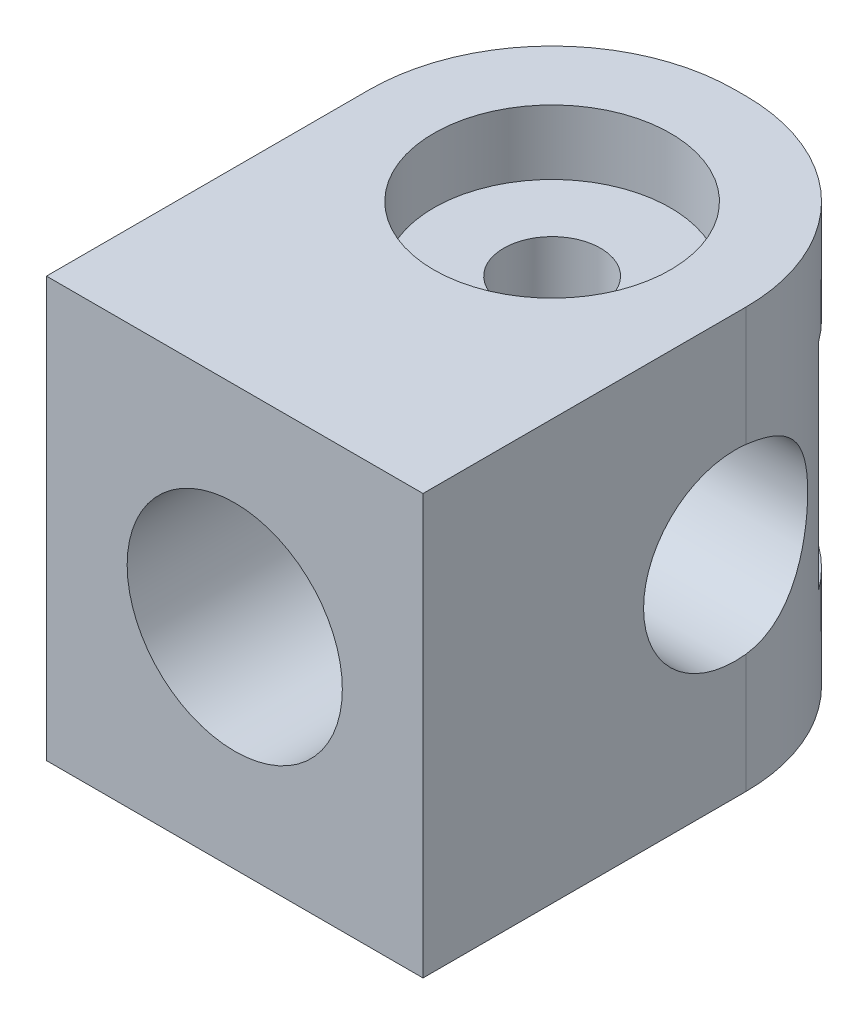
from build123d import *
from build123d.topology import SkipClean

# Parameters (mm, degrees)
ESQUISSE1_W             = 35
ESQUISSE1_H             = 39
BOSS_EXTRU_1_DEPTH      = 47
ENL_V_MAT_EXTRU_1_DEPTH = 20
CONG_1_R                = 17
ESQUISSE3_W             = 1
ESQUISSE3_H             = 20
ESQUISSE3_W_2           = 17
ENL_V_MAT_EXTRU_2_DEPTH = 7
ENL_V_MAT_EXTRU_3_DEPTH = 29
ESQUISSE5_R             = 4.5
ENL_V_MAT_EXTRU_4_DEPTH = 71.391760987
ESQUISSE7_R             = 11
ENL_V_MAT_EXTRU_5_DEPTH = 6
ENL_V_START             = -6
ESQUISSE8_R             = 11
ENL_V_MAT_EXTRU_6_DEPTH = 6
ENL_V_MAT_EXTRU_7_DEPTH = 6


with BuildPart() as part:
    # Esquisse1 → Boss.-Extru.1 (new body)
    with BuildSketch(Plane.XY):
        with Locations((17.5, -19.5)):
            Rectangle(ESQUISSE1_W, ESQUISSE1_H)
    extrude(amount=BOSS_EXTRU_1_DEPTH)

    # Esquisse2 → Enl_v. mat.-Extru.1 (cut)
    with BuildSketch(Plane.XY.offset(47)):
        with BuildLine():
            ThreePointArc((27.5, -19.5), (21.574863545, -10.367887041), (10.820902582, -12.057577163))
            Line((10.820902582, -12.057577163), (24.179097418, -26.942422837))
            ThreePointArc((24.179097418, -26.942422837), (26.632112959, -23.574863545), (27.5, -19.5))
        make_face()
        with BuildLine():
            Line((24.179097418, -26.942422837), (10.820902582, -12.057577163))
            ThreePointArc((10.820902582, -12.057577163), (10.057577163, -26.179097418), (24.179097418, -26.942422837))
        make_face()
        with BuildLine():
            ThreePointArc((27.5, -19.5), (21.574863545, -10.367887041), (10.820902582, -12.057577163))
            Line((10.820902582, -12.057577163), (24.179097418, -26.942422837))
            ThreePointArc((24.179097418, -26.942422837), (26.632112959, -23.574863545), (27.5, -19.5))
        make_face()
        with BuildLine():
            Line((24.179097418, -26.942422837), (10.820902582, -12.057577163))
            ThreePointArc((10.820902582, -12.057577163), (10.057577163, -26.179097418), (24.179097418, -26.942422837))
        make_face()
    extrude(amount=-ENL_V_MAT_EXTRU_1_DEPTH, mode=Mode.SUBTRACT)

    # Cong_1
    cong_1_edges = [part.edges().sort_by_distance(p)[0] for p in [
        (35, -19.5, 0),
        (0, -19.5, 0),
    ]]
    fillet(cong_1_edges, radius=CONG_1_R)

    # Esquisse3 → Enl_v. mat.-Extru.2 (cut)
    with BuildSketch(Plane(origin=(0, 0, 0), x_dir=(-1, 0, 0), z_dir=(0, 0, -1))):
        with Locations((-17.5, -19.5)):
            Rectangle(ESQUISSE3_W, ESQUISSE3_H)
        with Locations((-26.5, -19.5)):
            Rectangle(ESQUISSE3_W_2, ESQUISSE3_H)
        with Locations((-8.5, -19.5)):
            Rectangle(ESQUISSE3_W_2, ESQUISSE3_H)
    extrude(amount=-ENL_V_MAT_EXTRU_2_DEPTH, mode=Mode.SUBTRACT)

    # Esquisse4 → Enl_v. mat.-Extru.3 (cut)
    with BuildSketch(Plane(origin=(35, 0, 0), x_dir=(0, 0, -1), z_dir=(1, 0, 0))):
        with BuildLine():
            ThreePointArc((-18, -11), (-26.5, -19.5), (-18, -28))
            Line((-18, -28), (-18, -11))
        make_face()
        with BuildLine():
            Line((-17, -11.059028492), (-17, -27.940971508))
            ThreePointArc((-17, -27.940971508), (-11.645867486, -25.145794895), (-9.5, -19.5))
            ThreePointArc((-9.5, -19.5), (-11.645867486, -13.854205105), (-17, -11.059028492))
        make_face()
        with BuildLine():
            Line((-18, -11), (-18, -28))
            ThreePointArc((-18, -28), (-17.499129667, -27.985230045), (-17, -27.940971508))
            Line((-17, -27.940971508), (-17, -11.059028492))
            ThreePointArc((-17, -11.059028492), (-17.499129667, -11.014769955), (-18, -11))
        make_face()
    extrude(amount=-ENL_V_MAT_EXTRU_3_DEPTH, mode=Mode.SUBTRACT)

    # Esquisse5 → Enl_v. mat.-Extru.4 (cut, through all)
    with SkipClean():  # the faces are left unmerged after this step: merging them gives an invalid solid
        with BuildSketch(Plane(origin=(0, 0, 0), x_dir=(1, 0, 0), z_dir=(0, 1, 0))):
            with Locations(Location((17.5, -17.5, 0), (0, 0, 270))):
                Circle(ESQUISSE5_R)
        extrude(amount=-ENL_V_MAT_EXTRU_4_DEPTH, mode=Mode.SUBTRACT)

    # Esquisse7 → Enl_v. mat.-Extru.5 (cut)
    with SkipClean():  # the faces are left unmerged after this step: merging them gives an invalid solid
        with BuildSketch(Plane(origin=(0, 0, 0), x_dir=(1, 0, 0), z_dir=(0, 1, 0))):
            with Locations(Location((17.5, -17.5, 0), (0, 0, 270))):
                Circle(ESQUISSE7_R)
        extrude(amount=-ENL_V_MAT_EXTRU_5_DEPTH, mode=Mode.SUBTRACT)

    # Esquisse8 → Enl_v. mat.-Extru.6 (cut)
    with SkipClean():  # the faces are left unmerged after this step: merging them gives an invalid solid
        with BuildSketch(Plane.XZ.offset(39).offset(ENL_V_START)):
            with Locations(Location((17.5, 17.5, 0), (0, 0, 90))):
                Circle(ESQUISSE8_R)
        extrude(amount=ENL_V_MAT_EXTRU_6_DEPTH, mode=Mode.SUBTRACT)

    # Esquisse10 → Enl_v. mat.-Extru.7 (cut)
    with SkipClean():  # the faces are left unmerged after this step: merging them gives an invalid solid
        with BuildSketch(Plane.ZY):
            with BuildLine():
                ThreePointArc((17, -23.887482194), (20.80624304, -23.01781182), (22.5, -19.5))
                ThreePointArc((22.5, -19.5), (20.80624304, -15.98218818), (17, -15.112517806))
                Line((17, -15.112517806), (17, -23.887482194))
            make_face()
            with BuildLine():
                Line((17, -23.887482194), (17, -15.112517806))
                ThreePointArc((17, -15.112517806), (13.5, -19.5), (17, -23.887482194))
            make_face()
            with BuildLine():
                ThreePointArc((17, -23.887482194), (20.80624304, -23.01781182), (22.5, -19.5))
                ThreePointArc((22.5, -19.5), (20.80624304, -15.98218818), (17, -15.112517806))
                Line((17, -15.112517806), (17, -23.887482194))
            make_face()
            with BuildLine():
                Line((17, -23.887482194), (17, -15.112517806))
                ThreePointArc((17, -15.112517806), (13.5, -19.5), (17, -23.887482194))
            make_face()
        extrude(amount=-ENL_V_MAT_EXTRU_7_DEPTH, mode=Mode.SUBTRACT)


solid = part.part
